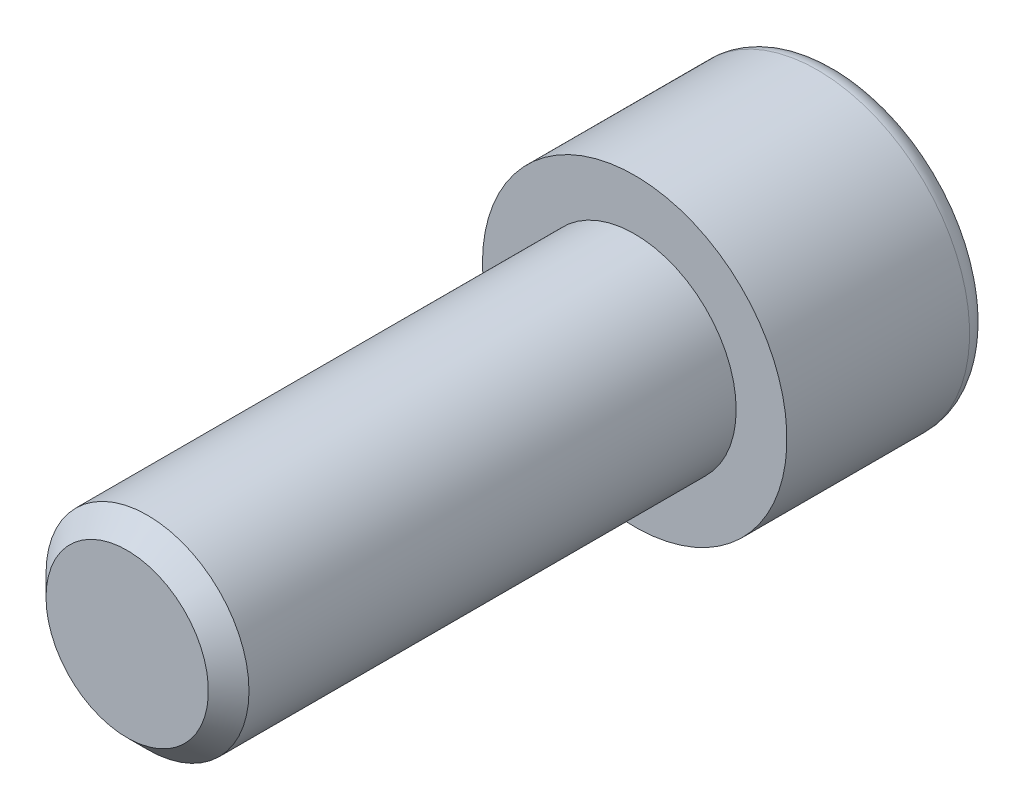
ISO-10303-21;
HEADER;
FILE_DESCRIPTION(('STEP AP214'),'2;1');
FILE_NAME('part.step','',(''),(''),'','','');
FILE_SCHEMA(('AUTOMOTIVE_DESIGN { 1 0 10303 214 1 1 1 1 }'));
ENDSEC;
DATA;
#1=APPLICATION_CONTEXT('core data for automotive mechanical design processes');
#2=APPLICATION_PROTOCOL_DEFINITION('international standard','automotive_design',2000,#1);
#3=PRODUCT_CONTEXT('',#1,'mechanical');
#4=PRODUCT('Part','Part','',(#3));
#5=PRODUCT_RELATED_PRODUCT_CATEGORY('part','',(#4));
#6=PRODUCT_DEFINITION_FORMATION('','',#4);
#7=PRODUCT_DEFINITION_CONTEXT('part definition',#1,'design');
#8=PRODUCT_DEFINITION('design','',#6,#7);
#9=PRODUCT_DEFINITION_SHAPE('','',#8);
#10=(LENGTH_UNIT() NAMED_UNIT(*) SI_UNIT(.MILLI.,.METRE.));
#11=(NAMED_UNIT(*) PLANE_ANGLE_UNIT() SI_UNIT($,.RADIAN.));
#12=(NAMED_UNIT(*) SI_UNIT($,.STERADIAN.) SOLID_ANGLE_UNIT());
#13=UNCERTAINTY_MEASURE_WITH_UNIT(LENGTH_MEASURE(1.E-05),#10,'distance_accuracy_value','');
#14=(GEOMETRIC_REPRESENTATION_CONTEXT(3) GLOBAL_UNCERTAINTY_ASSIGNED_CONTEXT((#13)) GLOBAL_UNIT_ASSIGNED_CONTEXT((#10,
#11,#12)) REPRESENTATION_CONTEXT('',''));
#15=CARTESIAN_POINT('',(0.,0.,0.));
#16=DIRECTION('',(0.,0.,1.));
#17=DIRECTION('',(1.,0.,0.));
#18=AXIS2_PLACEMENT_3D('',#15,#16,#17);
#19=CARTESIAN_POINT('',(0.,0.,-16.));
#20=DIRECTION('',(0.,0.,1.));
#21=DIRECTION('',(1.,0.,0.));
#22=AXIS2_PLACEMENT_3D('',#19,#20,#21);
#23=PLANE('',#22);
#24=CARTESIAN_POINT('',(0.,0.,-16.));
#25=DIRECTION('',(0.,0.,-1.));
#26=DIRECTION('',(-1.,0.,0.));
#27=AXIS2_PLACEMENT_3D('',#24,#25,#26);
#28=CIRCLE('',#27,10.4);
#29=CARTESIAN_POINT('',(-10.4,0.,-16.));
#30=VERTEX_POINT('',#29);
#31=EDGE_CURVE('E139',#30,#30,#28,.T.);
#32=ORIENTED_EDGE('',*,*,#31,.T.);
#33=EDGE_LOOP('',(#32));
#34=FACE_BOUND('',#33,.T.);
#35=DIRECTION('',(-0.86602540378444,0.499999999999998,0.));
#36=VECTOR('',#35,1.);
#37=CARTESIAN_POINT('',(0.,8.08290376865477,-16.));
#38=LINE('',#37,#36);
#39=CARTESIAN_POINT('',(7.,4.04145188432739,-16.));
#40=VERTEX_POINT('',#39);
#41=CARTESIAN_POINT('',(0.,8.08290376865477,-16.));
#42=VERTEX_POINT('',#41);
#43=EDGE_CURVE('E43',#40,#42,#38,.T.);
#44=ORIENTED_EDGE('',*,*,#43,.T.);
#45=DIRECTION('',(-0.866025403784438,-0.500000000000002,0.));
#46=VECTOR('',#45,1.);
#47=CARTESIAN_POINT('',(0.,8.08290376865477,-16.));
#48=LINE('',#47,#46);
#49=CARTESIAN_POINT('',(-7.,4.04145188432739,-16.));
#50=VERTEX_POINT('',#49);
#51=EDGE_CURVE('E83',#42,#50,#48,.T.);
#52=ORIENTED_EDGE('',*,*,#51,.T.);
#53=DIRECTION('',(0.,-1.,0.));
#54=VECTOR('',#53,1.);
#55=CARTESIAN_POINT('',(-7.,-4.04145188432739,-16.));
#56=LINE('',#55,#54);
#57=CARTESIAN_POINT('',(-7.,-4.04145188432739,-16.));
#58=VERTEX_POINT('',#57);
#59=EDGE_CURVE('E91',#50,#58,#56,.T.);
#60=ORIENTED_EDGE('',*,*,#59,.T.);
#61=DIRECTION('',(0.866025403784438,-0.500000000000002,0.));
#62=VECTOR('',#61,1.);
#63=CARTESIAN_POINT('',(0.,-8.08290376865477,-16.));
#64=LINE('',#63,#62);
#65=CARTESIAN_POINT('',(0.,-8.08290376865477,-16.));
#66=VERTEX_POINT('',#65);
#67=EDGE_CURVE('E109',#58,#66,#64,.T.);
#68=ORIENTED_EDGE('',*,*,#67,.T.);
#69=DIRECTION('',(0.86602540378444,0.499999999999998,0.));
#70=VECTOR('',#69,1.);
#71=CARTESIAN_POINT('',(0.,-8.08290376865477,-16.));
#72=LINE('',#71,#70);
#73=CARTESIAN_POINT('',(7.,-4.04145188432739,-16.));
#74=VERTEX_POINT('',#73);
#75=EDGE_CURVE('E112',#66,#74,#72,.T.);
#76=ORIENTED_EDGE('',*,*,#75,.T.);
#77=DIRECTION('',(0.,1.,0.));
#78=VECTOR('',#77,1.);
#79=CARTESIAN_POINT('',(7.,-4.04145188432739,-16.));
#80=LINE('',#79,#78);
#81=EDGE_CURVE('E102',#74,#40,#80,.T.);
#82=ORIENTED_EDGE('',*,*,#81,.T.);
#83=EDGE_LOOP('',(#44,#52,#60,#68,#76,#82));
#84=FACE_BOUND('',#83,.T.);
#85=ADVANCED_FACE('F29',(#34,#84),#23,.F.);
#86=CARTESIAN_POINT('',(0.,0.,-14.4));
#87=DIRECTION('',(0.,0.,-1.));
#88=DIRECTION('',(-1.,0.,0.));
#89=AXIS2_PLACEMENT_3D('',#86,#87,#88);
#90=TOROIDAL_SURFACE('',#89,10.4,1.6);
#91=ORIENTED_EDGE('',*,*,#31,.F.);
#92=EDGE_LOOP('',(#91));
#93=FACE_BOUND('',#92,.T.);
#94=CARTESIAN_POINT('',(0.,0.,-14.4));
#95=DIRECTION('',(0.,0.,-1.));
#96=DIRECTION('',(-1.,0.,0.));
#97=AXIS2_PLACEMENT_3D('',#94,#95,#96);
#98=CIRCLE('',#97,12.);
#99=CARTESIAN_POINT('',(-12.,0.,-14.4));
#100=VERTEX_POINT('',#99);
#101=EDGE_CURVE('E136',#100,#100,#98,.T.);
#102=ORIENTED_EDGE('',*,*,#101,.T.);
#103=EDGE_LOOP('',(#102));
#104=FACE_BOUND('',#103,.T.);
#105=ADVANCED_FACE('F158',(#93,#104),#90,.T.);
#106=CARTESIAN_POINT('',(0.,0.,0.));
#107=DIRECTION('',(0.,0.,-1.));
#108=DIRECTION('',(-1.,0.,0.));
#109=AXIS2_PLACEMENT_3D('',#106,#107,#108);
#110=CYLINDRICAL_SURFACE('',#109,12.);
#111=ORIENTED_EDGE('',*,*,#101,.F.);
#112=EDGE_LOOP('',(#111));
#113=FACE_BOUND('',#112,.T.);
#114=CARTESIAN_POINT('',(0.,0.,0.));
#115=DIRECTION('',(0.,0.,-1.));
#116=DIRECTION('',(-1.,0.,0.));
#117=AXIS2_PLACEMENT_3D('',#114,#115,#116);
#118=CIRCLE('',#117,12.);
#119=CARTESIAN_POINT('',(-12.,0.,0.));
#120=VERTEX_POINT('',#119);
#121=EDGE_CURVE('E97',#120,#120,#118,.T.);
#122=ORIENTED_EDGE('',*,*,#121,.T.);
#123=EDGE_LOOP('',(#122));
#124=FACE_BOUND('',#123,.T.);
#125=ADVANCED_FACE('F163',(#113,#124),#110,.T.);
#126=CARTESIAN_POINT('',(0.,0.,0.));
#127=DIRECTION('',(0.,0.,-1.));
#128=DIRECTION('',(-1.,0.,0.));
#129=AXIS2_PLACEMENT_3D('',#126,#127,#128);
#130=PLANE('',#129);
#131=CARTESIAN_POINT('',(0.,0.,0.));
#132=DIRECTION('',(0.,0.,1.));
#133=DIRECTION('',(1.,0.,0.));
#134=AXIS2_PLACEMENT_3D('',#131,#132,#133);
#135=CIRCLE('',#134,8.);
#136=CARTESIAN_POINT('',(8.,0.,0.));
#137=VERTEX_POINT('',#136);
#138=EDGE_CURVE('E103',#137,#137,#135,.T.);
#139=ORIENTED_EDGE('',*,*,#138,.F.);
#140=EDGE_LOOP('',(#139));
#141=FACE_BOUND('',#140,.T.);
#142=ORIENTED_EDGE('',*,*,#121,.F.);
#143=EDGE_LOOP('',(#142));
#144=FACE_BOUND('',#143,.T.);
#145=ADVANCED_FACE('F171',(#141,#144),#130,.F.);
#146=CARTESIAN_POINT('',(0.,8.08290376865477,-8.));
#147=DIRECTION('',(-0.499999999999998,-0.86602540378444,0.));
#148=DIRECTION('',(0.86602540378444,-0.499999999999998,0.));
#149=AXIS2_PLACEMENT_3D('',#146,#147,#148);
#150=PLANE('',#149);
#151=ORIENTED_EDGE('',*,*,#43,.F.);
#152=DIRECTION('',(0.,0.,-1.));
#153=VECTOR('',#152,1.);
#154=CARTESIAN_POINT('',(7.,4.04145188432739,-8.));
#155=LINE('',#154,#153);
#156=CARTESIAN_POINT('',(7.,4.04145188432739,-8.));
#157=VERTEX_POINT('',#156);
#158=EDGE_CURVE('E125',#157,#40,#155,.T.);
#159=ORIENTED_EDGE('',*,*,#158,.F.);
#160=DIRECTION('',(-0.86602540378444,0.499999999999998,0.));
#161=VECTOR('',#160,1.);
#162=CARTESIAN_POINT('',(0.,8.08290376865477,-8.));
#163=LINE('',#162,#161);
#164=CARTESIAN_POINT('',(0.,8.08290376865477,-8.));
#165=VERTEX_POINT('',#164);
#166=EDGE_CURVE('E96',#157,#165,#163,.T.);
#167=ORIENTED_EDGE('',*,*,#166,.T.);
#168=DIRECTION('',(0.,0.,-1.));
#169=VECTOR('',#168,1.);
#170=CARTESIAN_POINT('',(0.,8.08290376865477,-8.));
#171=LINE('',#170,#169);
#172=EDGE_CURVE('E85',#165,#42,#171,.T.);
#173=ORIENTED_EDGE('',*,*,#172,.T.);
#174=EDGE_LOOP('',(#151,#159,#167,#173));
#175=FACE_BOUND('',#174,.T.);
#176=ADVANCED_FACE('F94',(#175),#150,.T.);
#177=CARTESIAN_POINT('',(0.,8.08290376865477,-8.));
#178=DIRECTION('',(0.500000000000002,-0.866025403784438,0.));
#179=DIRECTION('',(0.866025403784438,0.500000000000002,0.));
#180=AXIS2_PLACEMENT_3D('',#177,#178,#179);
#181=PLANE('',#180);
#182=ORIENTED_EDGE('',*,*,#51,.F.);
#183=ORIENTED_EDGE('',*,*,#172,.F.);
#184=DIRECTION('',(-0.866025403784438,-0.500000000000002,0.));
#185=VECTOR('',#184,1.);
#186=CARTESIAN_POINT('',(0.,8.08290376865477,-8.));
#187=LINE('',#186,#185);
#188=CARTESIAN_POINT('',(-7.,4.04145188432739,-8.));
#189=VERTEX_POINT('',#188);
#190=EDGE_CURVE('E116',#165,#189,#187,.T.);
#191=ORIENTED_EDGE('',*,*,#190,.T.);
#192=DIRECTION('',(0.,0.,-1.));
#193=VECTOR('',#192,1.);
#194=CARTESIAN_POINT('',(-7.,4.04145188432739,-8.));
#195=LINE('',#194,#193);
#196=EDGE_CURVE('E87',#189,#50,#195,.T.);
#197=ORIENTED_EDGE('',*,*,#196,.T.);
#198=EDGE_LOOP('',(#182,#183,#191,#197));
#199=FACE_BOUND('',#198,.T.);
#200=ADVANCED_FACE('F84',(#199),#181,.T.);
#201=CARTESIAN_POINT('',(-7.,-4.04145188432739,-8.));
#202=DIRECTION('',(1.,0.,0.));
#203=DIRECTION('',(0.,0.,-1.));
#204=AXIS2_PLACEMENT_3D('',#201,#202,#203);
#205=PLANE('',#204);
#206=ORIENTED_EDGE('',*,*,#59,.F.);
#207=ORIENTED_EDGE('',*,*,#196,.F.);
#208=DIRECTION('',(0.,-1.,0.));
#209=VECTOR('',#208,1.);
#210=CARTESIAN_POINT('',(-7.,-4.04145188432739,-8.));
#211=LINE('',#210,#209);
#212=CARTESIAN_POINT('',(-7.,-4.04145188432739,-8.));
#213=VERTEX_POINT('',#212);
#214=EDGE_CURVE('E118',#189,#213,#211,.T.);
#215=ORIENTED_EDGE('',*,*,#214,.T.);
#216=DIRECTION('',(0.,0.,-1.));
#217=VECTOR('',#216,1.);
#218=CARTESIAN_POINT('',(-7.,-4.04145188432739,-8.));
#219=LINE('',#218,#217);
#220=EDGE_CURVE('E131',#213,#58,#219,.T.);
#221=ORIENTED_EDGE('',*,*,#220,.T.);
#222=EDGE_LOOP('',(#206,#207,#215,#221));
#223=FACE_BOUND('',#222,.T.);
#224=ADVANCED_FACE('F186',(#223),#205,.T.);
#225=CARTESIAN_POINT('',(0.,-8.08290376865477,-8.));
#226=DIRECTION('',(0.500000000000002,0.866025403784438,0.));
#227=DIRECTION('',(-0.866025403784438,0.500000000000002,0.));
#228=AXIS2_PLACEMENT_3D('',#225,#226,#227);
#229=PLANE('',#228);
#230=ORIENTED_EDGE('',*,*,#67,.F.);
#231=ORIENTED_EDGE('',*,*,#220,.F.);
#232=DIRECTION('',(0.866025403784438,-0.500000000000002,0.));
#233=VECTOR('',#232,1.);
#234=CARTESIAN_POINT('',(0.,-8.08290376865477,-8.));
#235=LINE('',#234,#233);
#236=CARTESIAN_POINT('',(0.,-8.08290376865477,-8.));
#237=VERTEX_POINT('',#236);
#238=EDGE_CURVE('E120',#213,#237,#235,.T.);
#239=ORIENTED_EDGE('',*,*,#238,.T.);
#240=DIRECTION('',(0.,0.,-1.));
#241=VECTOR('',#240,1.);
#242=CARTESIAN_POINT('',(0.,-8.08290376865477,-8.));
#243=LINE('',#242,#241);
#244=EDGE_CURVE('E129',#237,#66,#243,.T.);
#245=ORIENTED_EDGE('',*,*,#244,.T.);
#246=EDGE_LOOP('',(#230,#231,#239,#245));
#247=FACE_BOUND('',#246,.T.);
#248=ADVANCED_FACE('F189',(#247),#229,.T.);
#249=CARTESIAN_POINT('',(0.,-8.08290376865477,-8.));
#250=DIRECTION('',(-0.499999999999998,0.86602540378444,0.));
#251=DIRECTION('',(-0.86602540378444,-0.499999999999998,0.));
#252=AXIS2_PLACEMENT_3D('',#249,#250,#251);
#253=PLANE('',#252);
#254=ORIENTED_EDGE('',*,*,#75,.F.);
#255=ORIENTED_EDGE('',*,*,#244,.F.);
#256=DIRECTION('',(0.86602540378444,0.499999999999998,0.));
#257=VECTOR('',#256,1.);
#258=CARTESIAN_POINT('',(0.,-8.08290376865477,-8.));
#259=LINE('',#258,#257);
#260=CARTESIAN_POINT('',(7.,-4.04145188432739,-8.));
#261=VERTEX_POINT('',#260);
#262=EDGE_CURVE('E122',#237,#261,#259,.T.);
#263=ORIENTED_EDGE('',*,*,#262,.T.);
#264=DIRECTION('',(0.,0.,-1.));
#265=VECTOR('',#264,1.);
#266=CARTESIAN_POINT('',(7.,-4.04145188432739,-8.));
#267=LINE('',#266,#265);
#268=EDGE_CURVE('E127',#261,#74,#267,.T.);
#269=ORIENTED_EDGE('',*,*,#268,.T.);
#270=EDGE_LOOP('',(#254,#255,#263,#269));
#271=FACE_BOUND('',#270,.T.);
#272=ADVANCED_FACE('F193',(#271),#253,.T.);
#273=CARTESIAN_POINT('',(7.,-4.04145188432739,-8.));
#274=DIRECTION('',(-1.,0.,0.));
#275=DIRECTION('',(0.,0.,1.));
#276=AXIS2_PLACEMENT_3D('',#273,#274,#275);
#277=PLANE('',#276);
#278=ORIENTED_EDGE('',*,*,#81,.F.);
#279=ORIENTED_EDGE('',*,*,#268,.F.);
#280=DIRECTION('',(0.,1.,0.));
#281=VECTOR('',#280,1.);
#282=CARTESIAN_POINT('',(7.,-4.04145188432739,-8.));
#283=LINE('',#282,#281);
#284=EDGE_CURVE('E50',#261,#157,#283,.T.);
#285=ORIENTED_EDGE('',*,*,#284,.T.);
#286=ORIENTED_EDGE('',*,*,#158,.T.);
#287=EDGE_LOOP('',(#278,#279,#285,#286));
#288=FACE_BOUND('',#287,.T.);
#289=ADVANCED_FACE('F197',(#288),#277,.T.);
#290=CARTESIAN_POINT('',(7.,4.04145188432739,-8.));
#291=DIRECTION('',(0.,0.,1.));
#292=DIRECTION('',(1.,0.,0.));
#293=AXIS2_PLACEMENT_3D('',#290,#291,#292);
#294=PLANE('',#293);
#295=ORIENTED_EDGE('',*,*,#166,.F.);
#296=ORIENTED_EDGE('',*,*,#284,.F.);
#297=ORIENTED_EDGE('',*,*,#262,.F.);
#298=ORIENTED_EDGE('',*,*,#238,.F.);
#299=ORIENTED_EDGE('',*,*,#214,.F.);
#300=ORIENTED_EDGE('',*,*,#190,.F.);
#301=EDGE_LOOP('',(#295,#296,#297,#298,#299,#300));
#302=FACE_BOUND('',#301,.T.);
#303=ADVANCED_FACE('F201',(#302),#294,.F.);
#304=CARTESIAN_POINT('',(0.,0.,40.));
#305=DIRECTION('',(0.,0.,1.));
#306=DIRECTION('',(1.,0.,0.));
#307=AXIS2_PLACEMENT_3D('',#304,#305,#306);
#308=PLANE('',#307);
#309=CARTESIAN_POINT('',(0.,0.,40.));
#310=DIRECTION('',(0.,0.,1.));
#311=DIRECTION('',(1.,0.,0.));
#312=AXIS2_PLACEMENT_3D('',#309,#310,#311);
#313=CIRCLE('',#312,6.40000000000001);
#314=CARTESIAN_POINT('',(-6.4,0.,40.));
#315=VERTEX_POINT('',#314);
#316=EDGE_CURVE('E36',#315,#315,#313,.T.);
#317=ORIENTED_EDGE('',*,*,#316,.T.);
#318=EDGE_LOOP('',(#317));
#319=FACE_BOUND('',#318,.T.);
#320=ADVANCED_FACE('F144',(#319),#308,.T.);
#321=CARTESIAN_POINT('',(0.,0.,0.));
#322=DIRECTION('',(0.,0.,1.));
#323=DIRECTION('',(1.,0.,0.));
#324=AXIS2_PLACEMENT_3D('',#321,#322,#323);
#325=CYLINDRICAL_SURFACE('',#324,8.);
#326=CARTESIAN_POINT('',(0.,0.,38.4));
#327=DIRECTION('',(0.,0.,1.));
#328=DIRECTION('',(1.,0.,0.));
#329=AXIS2_PLACEMENT_3D('',#326,#327,#328);
#330=CIRCLE('',#329,8.);
#331=CARTESIAN_POINT('',(-7.99999999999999,0.,38.4));
#332=VERTEX_POINT('',#331);
#333=EDGE_CURVE('E11',#332,#332,#330,.F.);
#334=ORIENTED_EDGE('',*,*,#333,.T.);
#335=EDGE_LOOP('',(#334));
#336=FACE_BOUND('',#335,.T.);
#337=ORIENTED_EDGE('',*,*,#138,.T.);
#338=EDGE_LOOP('',(#337));
#339=FACE_BOUND('',#338,.T.);
#340=ADVANCED_FACE('F148',(#336,#339),#325,.T.);
#341=CARTESIAN_POINT('',(0.,0.,40.));
#342=DIRECTION('',(0.,0.,-1.));
#343=DIRECTION('',(-1.,0.,0.));
#344=AXIS2_PLACEMENT_3D('',#341,#342,#343);
#345=CONICAL_SURFACE('',#344,6.40000000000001,0.785398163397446);
#346=CARTESIAN_POINT('',(-7.99999999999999,0.,38.4));
#347=CARTESIAN_POINT('',(-7.98333333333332,0.,38.4166666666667));
#348=CARTESIAN_POINT('',(-7.96666666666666,0.,38.4333333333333));
#349=CARTESIAN_POINT('',(-7.93333333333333,0.,38.4666666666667));
#350=CARTESIAN_POINT('',(-7.91666666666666,0.,38.4833333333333));
#351=CARTESIAN_POINT('',(-7.88333333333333,0.,38.5166666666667));
#352=CARTESIAN_POINT('',(-7.86666666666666,0.,38.5333333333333));
#353=CARTESIAN_POINT('',(-7.83333333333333,0.,38.5666666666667));
#354=CARTESIAN_POINT('',(-7.81666666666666,0.,38.5833333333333));
#355=CARTESIAN_POINT('',(-7.78333333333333,0.,38.6166666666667));
#356=CARTESIAN_POINT('',(-7.76666666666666,0.,38.6333333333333));
#357=CARTESIAN_POINT('',(-7.73333333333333,0.,38.6666666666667));
#358=CARTESIAN_POINT('',(-7.71666666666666,0.,38.6833333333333));
#359=CARTESIAN_POINT('',(-7.68333333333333,0.,38.7166666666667));
#360=CARTESIAN_POINT('',(-7.66666666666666,0.,38.7333333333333));
#361=CARTESIAN_POINT('',(-7.63333333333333,0.,38.7666666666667));
#362=CARTESIAN_POINT('',(-7.61666666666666,0.,38.7833333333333));
#363=CARTESIAN_POINT('',(-7.58333333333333,0.,38.8166666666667));
#364=CARTESIAN_POINT('',(-7.56666666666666,0.,38.8333333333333));
#365=CARTESIAN_POINT('',(-7.53333333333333,0.,38.8666666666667));
#366=CARTESIAN_POINT('',(-7.51666666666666,0.,38.8833333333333));
#367=CARTESIAN_POINT('',(-7.48333333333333,0.,38.9166666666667));
#368=CARTESIAN_POINT('',(-7.46666666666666,0.,38.9333333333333));
#369=CARTESIAN_POINT('',(-7.43333333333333,0.,38.9666666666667));
#370=CARTESIAN_POINT('',(-7.41666666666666,0.,38.9833333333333));
#371=CARTESIAN_POINT('',(-7.38333333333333,0.,39.0166666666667));
#372=CARTESIAN_POINT('',(-7.36666666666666,0.,39.0333333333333));
#373=CARTESIAN_POINT('',(-7.33333333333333,0.,39.0666666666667));
#374=CARTESIAN_POINT('',(-7.31666666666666,0.,39.0833333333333));
#375=CARTESIAN_POINT('',(-7.28333333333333,0.,39.1166666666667));
#376=CARTESIAN_POINT('',(-7.26666666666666,0.,39.1333333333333));
#377=CARTESIAN_POINT('',(-7.23333333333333,0.,39.1666666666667));
#378=CARTESIAN_POINT('',(-7.21666666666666,0.,39.1833333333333));
#379=CARTESIAN_POINT('',(-7.18333333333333,0.,39.2166666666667));
#380=CARTESIAN_POINT('',(-7.16666666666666,0.,39.2333333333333));
#381=CARTESIAN_POINT('',(-7.13333333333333,0.,39.2666666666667));
#382=CARTESIAN_POINT('',(-7.11666666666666,0.,39.2833333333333));
#383=CARTESIAN_POINT('',(-7.08333333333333,0.,39.3166666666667));
#384=CARTESIAN_POINT('',(-7.06666666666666,0.,39.3333333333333));
#385=CARTESIAN_POINT('',(-7.03333333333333,0.,39.3666666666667));
#386=CARTESIAN_POINT('',(-7.01666666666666,0.,39.3833333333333));
#387=CARTESIAN_POINT('',(-6.98333333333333,0.,39.4166666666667));
#388=CARTESIAN_POINT('',(-6.96666666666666,0.,39.4333333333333));
#389=CARTESIAN_POINT('',(-6.93333333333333,0.,39.4666666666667));
#390=CARTESIAN_POINT('',(-6.91666666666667,0.,39.4833333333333));
#391=CARTESIAN_POINT('',(-6.88333333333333,0.,39.5166666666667));
#392=CARTESIAN_POINT('',(-6.86666666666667,0.,39.5333333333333));
#393=CARTESIAN_POINT('',(-6.83333333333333,0.,39.5666666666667));
#394=CARTESIAN_POINT('',(-6.81666666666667,0.,39.5833333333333));
#395=CARTESIAN_POINT('',(-6.78333333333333,0.,39.6166666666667));
#396=CARTESIAN_POINT('',(-6.76666666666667,0.,39.6333333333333));
#397=CARTESIAN_POINT('',(-6.73333333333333,0.,39.6666666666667));
#398=CARTESIAN_POINT('',(-6.71666666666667,0.,39.6833333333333));
#399=CARTESIAN_POINT('',(-6.68333333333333,0.,39.7166666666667));
#400=CARTESIAN_POINT('',(-6.66666666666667,0.,39.7333333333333));
#401=CARTESIAN_POINT('',(-6.63333333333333,0.,39.7666666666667));
#402=CARTESIAN_POINT('',(-6.61666666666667,0.,39.7833333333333));
#403=CARTESIAN_POINT('',(-6.58333333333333,0.,39.8166666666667));
#404=CARTESIAN_POINT('',(-6.56666666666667,0.,39.8333333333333));
#405=CARTESIAN_POINT('',(-6.53333333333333,0.,39.8666666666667));
#406=CARTESIAN_POINT('',(-6.51666666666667,0.,39.8833333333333));
#407=CARTESIAN_POINT('',(-6.48333333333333,0.,39.9166666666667));
#408=CARTESIAN_POINT('',(-6.46666666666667,0.,39.9333333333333));
#409=CARTESIAN_POINT('',(-6.43333333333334,0.,39.9666666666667));
#410=CARTESIAN_POINT('',(-6.41666666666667,0.,39.9833333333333));
#411=CARTESIAN_POINT('',(-6.4,0.,40.));
#412=B_SPLINE_CURVE_WITH_KNOTS('',3,(#346,#347,#348,#349,#350,#351,#352,#353,#354,#355,#356,
#357,#358,#359,#360,#361,#362,#363,#364,#365,#366,#367,#368,#369,#370,#371,#372,#373,#374,#375,
#376,#377,#378,#379,#380,#381,#382,#383,#384,#385,#386,#387,#388,#389,#390,#391,#392,#393,#394,
#395,#396,#397,#398,#399,#400,#401,#402,#403,#404,#405,#406,#407,#408,#409,#410,#411),
.UNSPECIFIED.,.F.,.F.,(4,2,2,2,2,2,2,2,2,2,2,2,2,2,2,2,2,2,2,2,2,2,2,2,2,2,2,2,2,2,2,2,4),(0.,
0.0707106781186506,0.141421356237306,0.212132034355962,0.282842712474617,0.353553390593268,
0.424264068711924,0.494974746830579,0.565685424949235,0.63639610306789,0.707106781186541,
0.777817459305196,0.848528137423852,0.919238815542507,0.989949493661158,1.06066017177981,
1.13137084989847,1.20208152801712,1.27279220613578,1.34350288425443,1.41421356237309,
1.48492424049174,1.5556349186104,1.62634559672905,1.6970562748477,1.76776695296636,
1.83847763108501,1.90918830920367,1.97989898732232,2.05060966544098,2.12132034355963,
2.19203102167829,2.26274169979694),.UNSPECIFIED.);
#413=EDGE_CURVE('BSEAM146',#332,#315,#412,.T.);
#414=ORIENTED_EDGE('',*,*,#333,.F.);
#415=ORIENTED_EDGE('',*,*,#316,.F.);
#416=ORIENTED_EDGE('',*,*,#413,.T.);
#417=ORIENTED_EDGE('',*,*,#413,.F.);
#418=EDGE_LOOP('',(#414,#416,#415,#417));
#419=FACE_BOUND('',#418,.T.);
#420=ADVANCED_FACE('F146',(#419),#345,.T.);
#421=CLOSED_SHELL('',(#85,#105,#125,#145,#176,#200,#224,#248,#272,#289,#303,#320,#340,#420));
#422=MANIFOLD_SOLID_BREP('B2',#421);
#423=ADVANCED_BREP_SHAPE_REPRESENTATION('',(#18,#422),#14);
#424=SHAPE_DEFINITION_REPRESENTATION(#9,#423);
ENDSEC;
END-ISO-10303-21;
